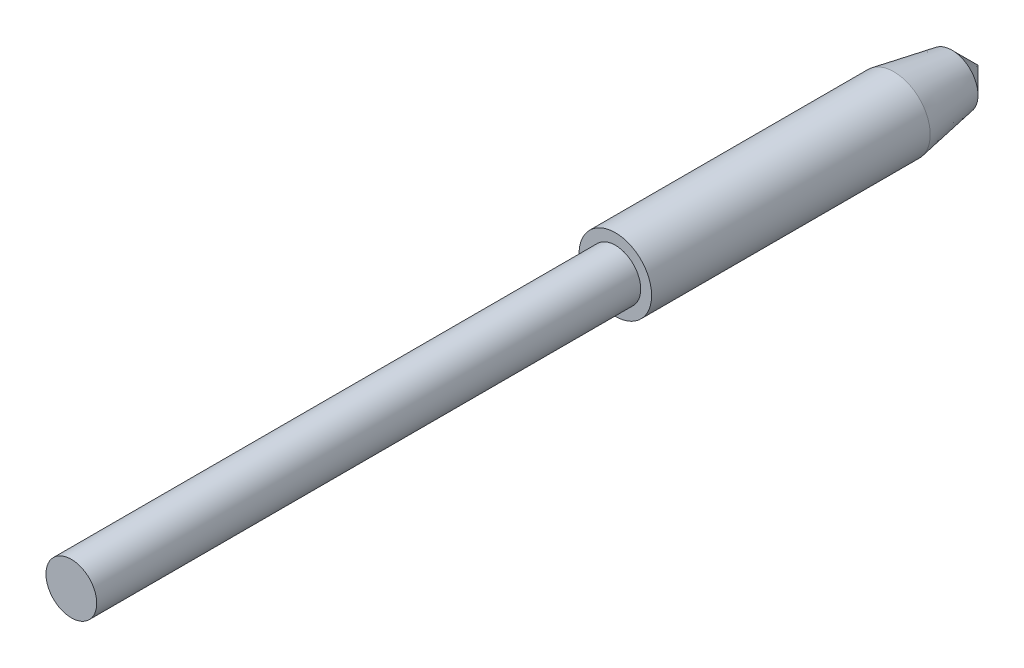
ISO-10303-21;
HEADER;
FILE_DESCRIPTION(('STEP AP214'),'2;1');
FILE_NAME('part.step','',(''),(''),'','','');
FILE_SCHEMA(('AUTOMOTIVE_DESIGN { 1 0 10303 214 1 1 1 1 }'));
ENDSEC;
DATA;
#1=APPLICATION_CONTEXT('core data for automotive mechanical design processes');
#2=APPLICATION_PROTOCOL_DEFINITION('international standard','automotive_design',2000,#1);
#3=PRODUCT_CONTEXT('',#1,'mechanical');
#4=PRODUCT('Part','Part','',(#3));
#5=PRODUCT_RELATED_PRODUCT_CATEGORY('part','',(#4));
#6=PRODUCT_DEFINITION_FORMATION('','',#4);
#7=PRODUCT_DEFINITION_CONTEXT('part definition',#1,'design');
#8=PRODUCT_DEFINITION('design','',#6,#7);
#9=PRODUCT_DEFINITION_SHAPE('','',#8);
#10=(LENGTH_UNIT() NAMED_UNIT(*) SI_UNIT(.MILLI.,.METRE.));
#11=(NAMED_UNIT(*) PLANE_ANGLE_UNIT() SI_UNIT($,.RADIAN.));
#12=(NAMED_UNIT(*) SI_UNIT($,.STERADIAN.) SOLID_ANGLE_UNIT());
#13=UNCERTAINTY_MEASURE_WITH_UNIT(LENGTH_MEASURE(1.E-05),#10,'distance_accuracy_value','');
#14=(GEOMETRIC_REPRESENTATION_CONTEXT(3) GLOBAL_UNCERTAINTY_ASSIGNED_CONTEXT((#13)) GLOBAL_UNIT_ASSIGNED_CONTEXT((#10,
#11,#12)) REPRESENTATION_CONTEXT('',''));
#15=CARTESIAN_POINT('',(0.,0.,0.));
#16=DIRECTION('',(0.,0.,1.));
#17=DIRECTION('',(1.,0.,0.));
#18=AXIS2_PLACEMENT_3D('',#15,#16,#17);
#19=CARTESIAN_POINT('',(0.,0.35,12.5));
#20=DIRECTION('',(0.,0.,-1.));
#21=DIRECTION('',(-1.,0.,0.));
#22=AXIS2_PLACEMENT_3D('',#19,#20,#21);
#23=PLANE('',#22);
#24=CARTESIAN_POINT('',(0.,0.,12.5));
#25=DIRECTION('',(0.,0.,1.));
#26=DIRECTION('',(1.,0.,0.));
#27=AXIS2_PLACEMENT_3D('',#24,#25,#26);
#28=CIRCLE('',#27,0.35);
#29=CARTESIAN_POINT('',(0.35,0.,12.5));
#30=VERTEX_POINT('',#29);
#31=EDGE_CURVE('E11',#30,#30,#28,.T.);
#32=ORIENTED_EDGE('',*,*,#31,.T.);
#33=EDGE_LOOP('',(#32));
#34=FACE_BOUND('',#33,.T.);
#35=ADVANCED_FACE('F33',(#34),#23,.F.);
#36=CARTESIAN_POINT('',(0.,0.,12.5));
#37=DIRECTION('',(0.,0.,1.));
#38=DIRECTION('',(1.,0.,0.));
#39=AXIS2_PLACEMENT_3D('',#36,#37,#38);
#40=CYLINDRICAL_SURFACE('',#39,0.35);
#41=ORIENTED_EDGE('',*,*,#31,.F.);
#42=EDGE_LOOP('',(#41));
#43=FACE_BOUND('',#42,.T.);
#44=CARTESIAN_POINT('',(0.,0.,5.));
#45=DIRECTION('',(0.,0.,1.));
#46=DIRECTION('',(1.,0.,0.));
#47=AXIS2_PLACEMENT_3D('',#44,#45,#46);
#48=CIRCLE('',#47,0.350000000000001);
#49=CARTESIAN_POINT('',(0.350000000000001,0.,5.));
#50=VERTEX_POINT('',#49);
#51=EDGE_CURVE('E39',#50,#50,#48,.T.);
#52=ORIENTED_EDGE('',*,*,#51,.T.);
#53=EDGE_LOOP('',(#52));
#54=FACE_BOUND('',#53,.T.);
#55=ADVANCED_FACE('F55',(#43,#54),#40,.T.);
#56=CARTESIAN_POINT('',(0.,0.5,5.));
#57=DIRECTION('',(0.,0.,-1.));
#58=DIRECTION('',(-1.,0.,0.));
#59=AXIS2_PLACEMENT_3D('',#56,#57,#58);
#60=PLANE('',#59);
#61=ORIENTED_EDGE('',*,*,#51,.F.);
#62=EDGE_LOOP('',(#61));
#63=FACE_BOUND('',#62,.T.);
#64=CARTESIAN_POINT('',(0.,0.,5.));
#65=DIRECTION('',(0.,0.,1.));
#66=DIRECTION('',(1.,0.,0.));
#67=AXIS2_PLACEMENT_3D('',#64,#65,#66);
#68=CIRCLE('',#67,0.5);
#69=CARTESIAN_POINT('',(0.5,0.,5.));
#70=VERTEX_POINT('',#69);
#71=EDGE_CURVE('E67',#70,#70,#68,.T.);
#72=ORIENTED_EDGE('',*,*,#71,.T.);
#73=EDGE_LOOP('',(#72));
#74=FACE_BOUND('',#73,.T.);
#75=ADVANCED_FACE('F60',(#63,#74),#60,.F.);
#76=CARTESIAN_POINT('',(0.,0.,12.5));
#77=DIRECTION('',(0.,0.,1.));
#78=DIRECTION('',(1.,0.,0.));
#79=AXIS2_PLACEMENT_3D('',#76,#77,#78);
#80=CYLINDRICAL_SURFACE('',#79,0.5);
#81=ORIENTED_EDGE('',*,*,#71,.F.);
#82=EDGE_LOOP('',(#81));
#83=FACE_BOUND('',#82,.T.);
#84=CARTESIAN_POINT('',(0.,0.,1.15893841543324));
#85=DIRECTION('',(0.,0.,1.));
#86=DIRECTION('',(1.,0.,0.));
#87=AXIS2_PLACEMENT_3D('',#84,#85,#86);
#88=CIRCLE('',#87,0.5);
#89=CARTESIAN_POINT('',(0.5,0.,1.15893841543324));
#90=VERTEX_POINT('',#89);
#91=EDGE_CURVE('E69',#90,#90,#88,.T.);
#92=ORIENTED_EDGE('',*,*,#91,.T.);
#93=EDGE_LOOP('',(#92));
#94=FACE_BOUND('',#93,.T.);
#95=ADVANCED_FACE('F50',(#83,#94),#80,.T.);
#96=CARTESIAN_POINT('',(0.,0.,0.358938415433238));
#97=DIRECTION('',(0.,0.,1.));
#98=DIRECTION('',(1.,0.,0.));
#99=AXIS2_PLACEMENT_3D('',#96,#97,#98);
#100=CONICAL_SURFACE('',#99,0.358938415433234,0.174532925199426);
#101=ORIENTED_EDGE('',*,*,#91,.F.);
#102=EDGE_LOOP('',(#101));
#103=FACE_BOUND('',#102,.T.);
#104=CARTESIAN_POINT('',(0.,0.,0.358938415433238));
#105=DIRECTION('',(0.,0.,1.));
#106=DIRECTION('',(1.,0.,0.));
#107=AXIS2_PLACEMENT_3D('',#104,#105,#106);
#108=CIRCLE('',#107,0.358938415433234);
#109=CARTESIAN_POINT('',(0.358938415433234,0.,0.358938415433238));
#110=VERTEX_POINT('',#109);
#111=EDGE_CURVE('E74',#110,#110,#108,.T.);
#112=ORIENTED_EDGE('',*,*,#111,.T.);
#113=EDGE_LOOP('',(#112));
#114=FACE_BOUND('',#113,.T.);
#115=ADVANCED_FACE('F44',(#103,#114),#100,.T.);
#116=CARTESIAN_POINT('',(0.,0.,0.));
#117=DIRECTION('',(0.,0.,1.));
#118=DIRECTION('',(1.,0.,0.));
#119=AXIS2_PLACEMENT_3D('',#116,#117,#118);
#120=CONICAL_SURFACE('',#119,0.,0.785398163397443);
#121=ORIENTED_EDGE('',*,*,#111,.F.);
#122=EDGE_LOOP('',(#121));
#123=FACE_BOUND('',#122,.T.);
#124=CARTESIAN_POINT('',(0.,0.,0.));
#125=VERTEX_POINT('',#124);
#126=VERTEX_LOOP('',#125);
#127=FACE_BOUND('',#126,.T.);
#128=ADVANCED_FACE('F42',(#123,#127),#120,.T.);
#129=CLOSED_SHELL('',(#35,#55,#75,#95,#115,#128));
#130=MANIFOLD_SOLID_BREP('B2',#129);
#131=ADVANCED_BREP_SHAPE_REPRESENTATION('',(#18,#130),#14);
#132=SHAPE_DEFINITION_REPRESENTATION(#9,#131);
ENDSEC;
END-ISO-10303-21;
